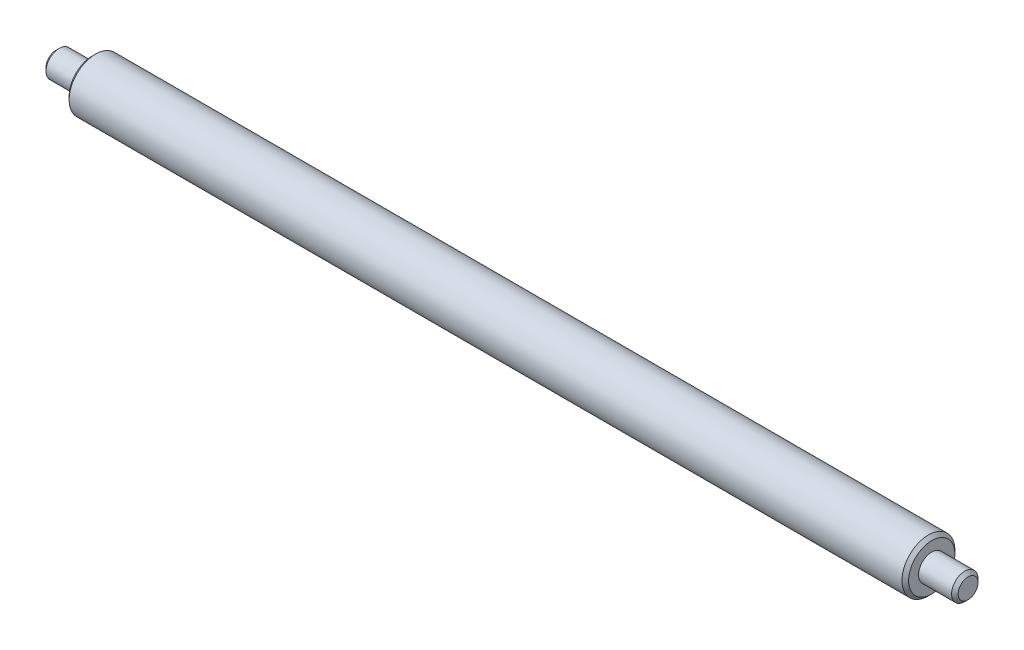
from build123d import *


with BuildPart() as part:
    # Esquisse1 → R_volution1 (revolve)
    with BuildSketch(Plane.XY, mode=Mode.PRIVATE) as r_volution1_sk:
        Polygon((-138, 0), (138, 0), (138, 3), (137, 4), (127, 4), (127, 7), (126, 8), (-126, 8), (-127, 7), (-127, 4), (-137, 4), (-138, 3), align=None)
    revolve(r_volution1_sk.sketch.rotate(Axis((-138, 0, 0), (1, 0, 0)), 90), axis=Axis((-138, 0, 0), (1, 0, 0)))


solid = part.part
